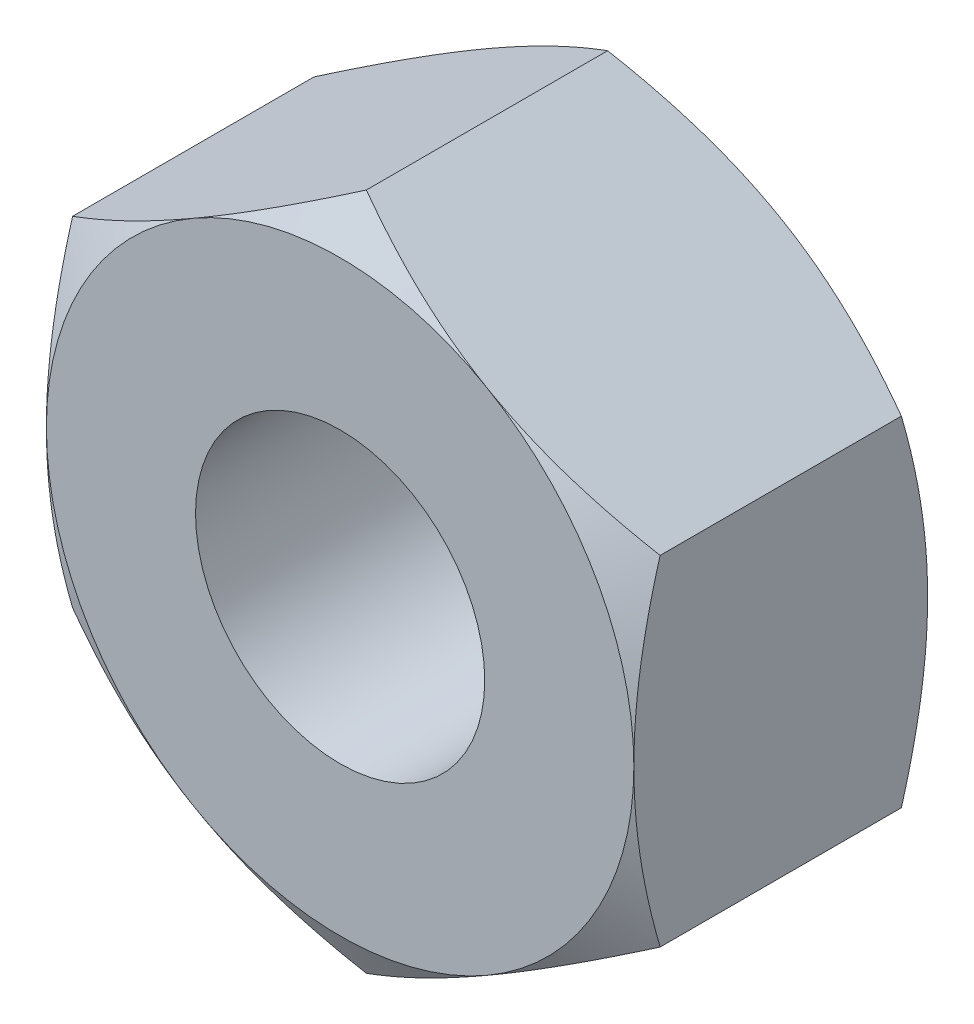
ISO-10303-21;
HEADER;
FILE_DESCRIPTION(('STEP AP214'),'2;1');
FILE_NAME('part.step','',(''),(''),'','','');
FILE_SCHEMA(('AUTOMOTIVE_DESIGN { 1 0 10303 214 1 1 1 1 }'));
ENDSEC;
DATA;
#1=APPLICATION_CONTEXT('core data for automotive mechanical design processes');
#2=APPLICATION_PROTOCOL_DEFINITION('international standard','automotive_design',2000,#1);
#3=PRODUCT_CONTEXT('',#1,'mechanical');
#4=PRODUCT('Part','Part','',(#3));
#5=PRODUCT_RELATED_PRODUCT_CATEGORY('part','',(#4));
#6=PRODUCT_DEFINITION_FORMATION('','',#4);
#7=PRODUCT_DEFINITION_CONTEXT('part definition',#1,'design');
#8=PRODUCT_DEFINITION('design','',#6,#7);
#9=PRODUCT_DEFINITION_SHAPE('','',#8);
#10=(LENGTH_UNIT() NAMED_UNIT(*) SI_UNIT(.MILLI.,.METRE.));
#11=(NAMED_UNIT(*) PLANE_ANGLE_UNIT() SI_UNIT($,.RADIAN.));
#12=(NAMED_UNIT(*) SI_UNIT($,.STERADIAN.) SOLID_ANGLE_UNIT());
#13=UNCERTAINTY_MEASURE_WITH_UNIT(LENGTH_MEASURE(1.E-05),#10,'distance_accuracy_value','');
#14=(GEOMETRIC_REPRESENTATION_CONTEXT(3) GLOBAL_UNCERTAINTY_ASSIGNED_CONTEXT((#13)) GLOBAL_UNIT_ASSIGNED_CONTEXT((#10,
#11,#12)) REPRESENTATION_CONTEXT('',''));
#15=CARTESIAN_POINT('',(0.,0.,0.));
#16=DIRECTION('',(0.,0.,1.));
#17=DIRECTION('',(1.,0.,0.));
#18=AXIS2_PLACEMENT_3D('',#15,#16,#17);
#19=CARTESIAN_POINT('',(-6.5,11.2583302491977,0.));
#20=DIRECTION('',(0.,0.,-1.));
#21=DIRECTION('',(-1.,0.,0.));
#22=AXIS2_PLACEMENT_3D('',#19,#20,#21);
#23=PLANE('',#22);
#24=CARTESIAN_POINT('',(0.,0.,0.));
#25=DIRECTION('',(0.,0.,-1.));
#26=DIRECTION('',(-1.,0.,0.));
#27=AXIS2_PLACEMENT_3D('',#24,#25,#26);
#28=CIRCLE('',#27,6.5);
#29=CARTESIAN_POINT('',(-6.5,0.,0.));
#30=VERTEX_POINT('',#29);
#31=CARTESIAN_POINT('',(-3.25,5.62916512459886,0.));
#32=VERTEX_POINT('',#31);
#33=EDGE_CURVE('E474',#30,#32,#28,.T.);
#34=ORIENTED_EDGE('',*,*,#33,.F.);
#35=CARTESIAN_POINT('',(0.,0.,0.));
#36=DIRECTION('',(0.,0.,-1.));
#37=DIRECTION('',(-1.,0.,0.));
#38=AXIS2_PLACEMENT_3D('',#35,#36,#37);
#39=CIRCLE('',#38,6.5);
#40=CARTESIAN_POINT('',(-3.25,-5.62916512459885,0.));
#41=VERTEX_POINT('',#40);
#42=EDGE_CURVE('E151',#30,#41,#39,.F.);
#43=ORIENTED_EDGE('',*,*,#42,.T.);
#44=CARTESIAN_POINT('',(3.25,-5.62916512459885,0.));
#45=VERTEX_POINT('',#44);
#46=EDGE_CURVE('E253',#41,#45,#39,.F.);
#47=ORIENTED_EDGE('',*,*,#46,.T.);
#48=CARTESIAN_POINT('',(6.5,0.,0.));
#49=VERTEX_POINT('',#48);
#50=EDGE_CURVE('E155',#45,#49,#39,.F.);
#51=ORIENTED_EDGE('',*,*,#50,.T.);
#52=CARTESIAN_POINT('',(3.25,5.62916512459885,0.));
#53=VERTEX_POINT('',#52);
#54=EDGE_CURVE('E129',#49,#53,#39,.F.);
#55=ORIENTED_EDGE('',*,*,#54,.T.);
#56=EDGE_CURVE('E142',#53,#32,#39,.F.);
#57=ORIENTED_EDGE('',*,*,#56,.T.);
#58=EDGE_LOOP('',(#34,#43,#47,#51,#55,#57));
#59=FACE_BOUND('',#58,.T.);
#60=CARTESIAN_POINT('',(0.,0.,0.));
#61=DIRECTION('',(0.,0.,1.));
#62=DIRECTION('',(1.,0.,0.));
#63=AXIS2_PLACEMENT_3D('',#60,#61,#62);
#64=CIRCLE('',#63,3.2);
#65=CARTESIAN_POINT('',(3.2,0.,0.));
#66=VERTEX_POINT('',#65);
#67=EDGE_CURVE('E467',#66,#66,#64,.T.);
#68=ORIENTED_EDGE('',*,*,#67,.F.);
#69=EDGE_LOOP('',(#68));
#70=FACE_BOUND('',#69,.T.);
#71=ADVANCED_FACE('F34',(#59,#70),#23,.F.);
#72=CARTESIAN_POINT('',(0.,0.,0.));
#73=DIRECTION('',(0.,0.,-1.));
#74=DIRECTION('',(-1.,0.,0.));
#75=AXIS2_PLACEMENT_3D('',#72,#73,#74);
#76=CONICAL_SURFACE('',#75,6.5,1.0471975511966);
#77=CARTESIAN_POINT('',(-6.5,-10.0985149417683,-3.18095730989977));
#78=CARTESIAN_POINT('',(-6.5,-9.81442448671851,-3.04307530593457));
#79=CARTESIAN_POINT('',(-6.5,-9.52968373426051,-2.90651030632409));
#80=CARTESIAN_POINT('',(-6.5,-8.95855580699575,-2.63675480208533));
#81=CARTESIAN_POINT('',(-6.5,-8.67216838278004,-2.50356482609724));
#82=CARTESIAN_POINT('',(-6.5,-8.09593488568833,-2.24063387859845));
#83=CARTESIAN_POINT('',(-6.5,-7.80607848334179,-2.11091546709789));
#84=CARTESIAN_POINT('',(-6.5,-7.22406608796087,-1.85676431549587));
#85=CARTESIAN_POINT('',(-6.5,-6.93191020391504,-1.73233132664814));
#86=CARTESIAN_POINT('',(-6.5,-6.33541861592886,-1.48626189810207));
#87=CARTESIAN_POINT('',(-6.5,-6.03099269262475,-1.36484297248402));
#88=CARTESIAN_POINT('',(-6.5,-5.41858592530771,-1.13115091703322));
#89=CARTESIAN_POINT('',(-6.5,-5.11060468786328,-1.01887881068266));
#90=CARTESIAN_POINT('',(-6.5,-4.49116870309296,-0.80641352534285));
#91=CARTESIAN_POINT('',(-6.5,-4.17972236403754,-0.706196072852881));
#92=CARTESIAN_POINT('',(-6.5,-3.55235928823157,-0.521044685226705));
#93=CARTESIAN_POINT('',(-6.5,-3.23644398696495,-0.436105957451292));
#94=CARTESIAN_POINT('',(-6.5,-2.6016924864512,-0.286014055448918));
#95=CARTESIAN_POINT('',(-6.5,-2.28288159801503,-0.220755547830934));
#96=CARTESIAN_POINT('',(-6.5,-1.64123192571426,-0.113730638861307));
#97=CARTESIAN_POINT('',(-6.5,-1.31839354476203,-0.0719619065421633));
#98=CARTESIAN_POINT('',(-6.5,-0.834548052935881,-0.0296987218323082));
#99=CARTESIAN_POINT('',(-6.5,-0.674391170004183,-0.0190142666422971));
#100=CARTESIAN_POINT('',(-6.5,-0.353761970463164,-0.00442284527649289));
#101=CARTESIAN_POINT('',(-6.5,-0.193289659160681,-0.000515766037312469));
#102=CARTESIAN_POINT('',(-6.5,0.127675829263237,0.000420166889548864));
#103=CARTESIAN_POINT('',(-6.5,0.288169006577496,-0.00255104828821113));
#104=CARTESIAN_POINT('',(-6.5,0.60888746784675,-0.0152969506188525));
#105=CARTESIAN_POINT('',(-6.5,0.769112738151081,-0.0250719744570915));
#106=CARTESIAN_POINT('',(-6.5,1.15356140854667,-0.0564825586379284));
#107=CARTESIAN_POINT('',(-6.5,1.37752936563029,-0.0813118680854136));
#108=CARTESIAN_POINT('',(-6.5,1.82380504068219,-0.142915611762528));
#109=CARTESIAN_POINT('',(-6.5,2.04611253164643,-0.179691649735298));
#110=CARTESIAN_POINT('',(-6.5,2.71028289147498,-0.305989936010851));
#111=CARTESIAN_POINT('',(-6.5,3.14915331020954,-0.411460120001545));
#112=CARTESIAN_POINT('',(-6.5,3.80555173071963,-0.594419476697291));
#113=CARTESIAN_POINT('',(-6.5,4.02648029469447,-0.660410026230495));
#114=CARTESIAN_POINT('',(-6.5,4.46619094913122,-0.799255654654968));
#115=CARTESIAN_POINT('',(-6.5,4.68497302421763,-0.872110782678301));
#116=CARTESIAN_POINT('',(-6.5,5.12046127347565,-1.02351546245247));
#117=CARTESIAN_POINT('',(-6.5,5.33716808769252,-1.10206318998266));
#118=CARTESIAN_POINT('',(-6.5,5.76878342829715,-1.26392758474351));
#119=CARTESIAN_POINT('',(-6.5,5.98369198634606,-1.34724416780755));
#120=CARTESIAN_POINT('',(-6.5,6.5321333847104,-1.56574701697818));
#121=CARTESIAN_POINT('',(-6.5,6.86452551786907,-1.70379279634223));
#122=CARTESIAN_POINT('',(-6.5,7.52616114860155,-1.98725828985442));
#123=CARTESIAN_POINT('',(-6.5,7.85540437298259,-2.1326786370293));
#124=CARTESIAN_POINT('',(-6.5,8.51141095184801,-2.42925370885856));
#125=CARTESIAN_POINT('',(-6.5,8.8381735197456,-2.58041016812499));
#126=CARTESIAN_POINT('',(-6.5,9.48958511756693,-2.8871718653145));
#127=CARTESIAN_POINT('',(-6.5,9.81423421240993,-3.0427769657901));
#128=CARTESIAN_POINT('',(-6.5,10.4622514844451,-3.35773382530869));
#129=CARTESIAN_POINT('',(-6.5,10.7856173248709,-3.51709038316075));
#130=CARTESIAN_POINT('',(-6.5,11.4309268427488,-3.83865748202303));
#131=CARTESIAN_POINT('',(-6.5,11.7528705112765,-4.00086804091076));
#132=CARTESIAN_POINT('',(-6.5,12.7168301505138,-4.49089619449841));
#133=CARTESIAN_POINT('',(-6.5,13.357090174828,-4.82216687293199));
#134=CARTESIAN_POINT('',(-6.5,14.5727884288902,-5.45876646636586));
#135=CARTESIAN_POINT('',(-6.5,15.1485293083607,-5.76352010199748));
#136=CARTESIAN_POINT('',(-6.5,16.2980144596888,-6.37683449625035));
#137=CARTESIAN_POINT('',(-6.5,16.8717586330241,-6.685395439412));
#138=CARTESIAN_POINT('',(-6.5,18.0160290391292,-7.30445932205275));
#139=CARTESIAN_POINT('',(-6.5,18.5865597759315,-7.61495394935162));
#140=CARTESIAN_POINT('',(-6.5,19.7263670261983,-8.23814804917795));
#141=CARTESIAN_POINT('',(-6.5,20.2956436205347,-8.55084737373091));
#142=CARTESIAN_POINT('',(-6.5,20.8644710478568,-8.86435647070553));
#143=B_SPLINE_CURVE_WITH_KNOTS('',3,(#77,#78,#79,#80,#81,#82,#83,#84,#85,#86,#87,#88,#89,#90,
#91,#92,#93,#94,#95,#96,#97,#98,#99,#100,#101,#102,#103,#104,#105,#106,#107,#108,#109,#110,#111,
#112,#113,#114,#115,#116,#117,#118,#119,#120,#121,#122,#123,#124,#125,#126,#127,#128,#129,#130,
#131,#132,#133,#134,#135,#136,#137,#138,#139,#140,#141,#142),.UNSPECIFIED.,.F.,.F.,(4,2,2,2,2,2,
2,2,2,2,2,2,2,2,2,2,2,2,2,2,2,2,2,2,2,2,2,2,2,2,2,2,4),(0.,0.947360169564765,1.89486782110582,
2.84750200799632,3.80009131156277,4.78321700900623,5.76645256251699,6.74767387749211,
7.72858686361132,8.70415257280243,9.67962145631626,10.1610384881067,10.6424474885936,
11.1238613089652,11.6052989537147,12.2809380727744,12.9566679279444,14.3088484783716,
15.0005111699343,15.6921788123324,16.3836257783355,17.0750605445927,18.1546874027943,
19.2344070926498,20.3144559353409,21.3944714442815,22.4759529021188,23.5574411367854,
25.7200319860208,27.6742871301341,29.628637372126,31.5772753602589,33.5257837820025),.UNSPECIFIED.);
#144=CARTESIAN_POINT('',(-6.5,3.75277674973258,-0.580556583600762));
#145=VERTEX_POINT('',#144);
#146=EDGE_CURVE('E160',#145,#30,#143,.F.);
#147=ORIENTED_EDGE('',*,*,#146,.T.);
#148=ORIENTED_EDGE('',*,*,#33,.T.);
#149=CARTESIAN_POINT('',(0.000200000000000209,7.50566896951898,-0.580623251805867));
#150=CARTESIAN_POINT('',(-0.14267745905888,7.42317863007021,-0.533004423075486));
#151=CARTESIAN_POINT('',(-0.286087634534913,7.34038072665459,-0.487546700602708));
#152=CARTESIAN_POINT('',(-0.574072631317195,7.17411251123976,-0.401548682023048));
#153=CARTESIAN_POINT('',(-0.718647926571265,7.09064192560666,-0.361010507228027));
#154=CARTESIAN_POINT('',(-1.15468865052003,6.8388936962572,-0.247571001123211));
#155=CARTESIAN_POINT('',(-1.44787528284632,6.66962231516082,-0.183047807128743));
#156=CARTESIAN_POINT('',(-1.88662374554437,6.41631077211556,-0.107386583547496));
#157=CARTESIAN_POINT('',(-2.03087463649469,6.33302748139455,-0.0858328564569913));
#158=CARTESIAN_POINT('',(-2.32002821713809,6.16608458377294,-0.0496903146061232));
#159=CARTESIAN_POINT('',(-2.46493084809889,6.08242501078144,-0.0351008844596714));
#160=CARTESIAN_POINT('',(-2.75498777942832,5.91496056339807,-0.013258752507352));
#161=CARTESIAN_POINT('',(-2.90014160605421,5.83115596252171,-0.00599772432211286));
#162=CARTESIAN_POINT('',(-3.19057533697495,5.66347396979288,0.00103969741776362));
#163=CARTESIAN_POINT('',(-3.33585523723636,5.57959658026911,0.000816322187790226));
#164=CARTESIAN_POINT('',(-3.7338759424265,5.34979921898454,-0.0100834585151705));
#165=CARTESIAN_POINT('',(-3.98648646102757,5.20395446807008,-0.0283818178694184));
#166=CARTESIAN_POINT('',(-4.49002967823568,4.91323365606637,-0.0864063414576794));
#167=CARTESIAN_POINT('',(-4.74096060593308,4.76835861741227,-0.126152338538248));
#168=CARTESIAN_POINT('',(-5.24551722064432,4.47705272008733,-0.225505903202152));
#169=CARTESIAN_POINT('',(-5.49907924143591,4.33065861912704,-0.285534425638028));
#170=CARTESIAN_POINT('',(-6.00242193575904,4.04005357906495,-0.421774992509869));
#171=CARTESIAN_POINT('',(-6.25220905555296,3.89583891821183,-0.497955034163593));
#172=CARTESIAN_POINT('',(-6.5002,3.75266127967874,-0.580623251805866));
#173=B_SPLINE_CURVE_WITH_KNOTS('',3,(#149,#150,#151,#152,#153,#154,#155,#156,#157,#158,#159,
#160,#161,#162,#163,#164,#165,#166,#167,#168,#169,#170,#171,#172),.UNSPECIFIED.,.F.,.F.,(4,2,2,
2,2,2,2,2,2,2,2,4),(0.,0.515105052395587,1.03043143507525,2.06322554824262,2.56697389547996,
3.07067772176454,3.57380860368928,4.0769239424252,4.9527935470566,5.82947446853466,
6.72559912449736,7.61996451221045),.UNSPECIFIED.);
#174=EDGE_CURVE('E192',#32,#145,#173,.T.);
#175=ORIENTED_EDGE('',*,*,#174,.T.);
#176=EDGE_LOOP('',(#147,#148,#175));
#177=FACE_BOUND('',#176,.T.);
#178=ADVANCED_FACE('F179',(#177),#76,.T.);
#179=CARTESIAN_POINT('',(6.5002,3.75266127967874,-0.580623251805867));
#180=CARTESIAN_POINT('',(6.35732254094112,3.83515161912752,-0.533004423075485));
#181=CARTESIAN_POINT('',(6.21391236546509,3.91794952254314,-0.487546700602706));
#182=CARTESIAN_POINT('',(5.9259273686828,4.08421773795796,-0.401548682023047));
#183=CARTESIAN_POINT('',(5.78135207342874,4.16768832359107,-0.361010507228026));
#184=CARTESIAN_POINT('',(5.34531134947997,4.41943655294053,-0.247571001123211));
#185=CARTESIAN_POINT('',(5.05212471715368,4.58870793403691,-0.183047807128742));
#186=CARTESIAN_POINT('',(4.61337625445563,4.84201947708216,-0.107386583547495));
#187=CARTESIAN_POINT('',(4.46912536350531,4.92530276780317,-0.0858328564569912));
#188=CARTESIAN_POINT('',(4.17997178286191,5.09224566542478,-0.0496903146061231));
#189=CARTESIAN_POINT('',(4.03506915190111,5.17590523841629,-0.035100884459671));
#190=CARTESIAN_POINT('',(3.74501222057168,5.34336968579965,-0.0132587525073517));
#191=CARTESIAN_POINT('',(3.59985839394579,5.42717428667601,-0.005997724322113));
#192=CARTESIAN_POINT('',(3.30942466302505,5.59485627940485,0.00103969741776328));
#193=CARTESIAN_POINT('',(3.16414476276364,5.67873366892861,0.000816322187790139));
#194=CARTESIAN_POINT('',(2.7661240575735,5.90853103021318,-0.0100834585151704));
#195=CARTESIAN_POINT('',(2.51351353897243,6.05437578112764,-0.0283818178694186));
#196=CARTESIAN_POINT('',(2.00997032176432,6.34509659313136,-0.0864063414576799));
#197=CARTESIAN_POINT('',(1.75903939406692,6.48997163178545,-0.126152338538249));
#198=CARTESIAN_POINT('',(1.25448277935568,6.78127752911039,-0.225505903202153));
#199=CARTESIAN_POINT('',(1.00092075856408,6.92767163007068,-0.28553442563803));
#200=CARTESIAN_POINT('',(0.497578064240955,7.21827667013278,-0.42177499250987));
#201=CARTESIAN_POINT('',(0.247790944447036,7.3624913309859,-0.497955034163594));
#202=CARTESIAN_POINT('',(-0.000199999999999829,7.50566896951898,-0.580623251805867));
#203=B_SPLINE_CURVE_WITH_KNOTS('',3,(#179,#180,#181,#182,#183,#184,#185,#186,#187,#188,#189,
#190,#191,#192,#193,#194,#195,#196,#197,#198,#199,#200,#201,#202),.UNSPECIFIED.,.F.,.F.,(4,2,2,
2,2,2,2,2,2,2,2,4),(0.,0.515105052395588,1.03043143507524,2.06322554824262,2.56697389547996,
3.07067772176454,3.57380860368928,4.0769239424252,4.9527935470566,5.82947446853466,
6.72559912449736,7.61996451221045),.UNSPECIFIED.);
#204=CARTESIAN_POINT('',(0.,7.50555349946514,-0.580556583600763));
#205=VERTEX_POINT('',#204);
#206=EDGE_CURVE('E138',#53,#205,#203,.T.);
#207=ORIENTED_EDGE('',*,*,#206,.T.);
#208=EDGE_CURVE('E145',#205,#32,#173,.T.);
#209=ORIENTED_EDGE('',*,*,#208,.T.);
#210=ORIENTED_EDGE('',*,*,#56,.F.);
#211=EDGE_LOOP('',(#207,#209,#210));
#212=FACE_BOUND('',#211,.T.);
#213=ADVANCED_FACE('F143',(#212),#76,.T.);
#214=CARTESIAN_POINT('',(6.5,-10.0985149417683,-3.18095730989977));
#215=CARTESIAN_POINT('',(6.5,-9.81442448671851,-3.04307530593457));
#216=CARTESIAN_POINT('',(6.5,-9.52968373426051,-2.90651030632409));
#217=CARTESIAN_POINT('',(6.5,-8.95855580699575,-2.63675480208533));
#218=CARTESIAN_POINT('',(6.5,-8.67216838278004,-2.50356482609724));
#219=CARTESIAN_POINT('',(6.5,-8.09593488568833,-2.24063387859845));
#220=CARTESIAN_POINT('',(6.5,-7.80607848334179,-2.11091546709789));
#221=CARTESIAN_POINT('',(6.5,-7.22406608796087,-1.85676431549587));
#222=CARTESIAN_POINT('',(6.5,-6.93191020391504,-1.73233132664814));
#223=CARTESIAN_POINT('',(6.5,-6.33541861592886,-1.48626189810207));
#224=CARTESIAN_POINT('',(6.5,-6.03099269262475,-1.36484297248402));
#225=CARTESIAN_POINT('',(6.5,-5.41858592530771,-1.13115091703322));
#226=CARTESIAN_POINT('',(6.5,-5.11060468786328,-1.01887881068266));
#227=CARTESIAN_POINT('',(6.5,-4.49116870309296,-0.80641352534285));
#228=CARTESIAN_POINT('',(6.5,-4.17972236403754,-0.706196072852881));
#229=CARTESIAN_POINT('',(6.5,-3.55235928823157,-0.521044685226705));
#230=CARTESIAN_POINT('',(6.5,-3.23644398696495,-0.436105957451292));
#231=CARTESIAN_POINT('',(6.5,-2.6016924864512,-0.286014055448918));
#232=CARTESIAN_POINT('',(6.5,-2.28288159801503,-0.220755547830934));
#233=CARTESIAN_POINT('',(6.5,-1.64123192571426,-0.113730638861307));
#234=CARTESIAN_POINT('',(6.5,-1.31839354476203,-0.0719619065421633));
#235=CARTESIAN_POINT('',(6.5,-0.834548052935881,-0.0296987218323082));
#236=CARTESIAN_POINT('',(6.5,-0.674391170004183,-0.0190142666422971));
#237=CARTESIAN_POINT('',(6.5,-0.353761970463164,-0.00442284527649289));
#238=CARTESIAN_POINT('',(6.5,-0.193289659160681,-0.000515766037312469));
#239=CARTESIAN_POINT('',(6.5,0.127675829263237,0.000420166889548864));
#240=CARTESIAN_POINT('',(6.5,0.288169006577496,-0.00255104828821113));
#241=CARTESIAN_POINT('',(6.5,0.60888746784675,-0.0152969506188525));
#242=CARTESIAN_POINT('',(6.5,0.769112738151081,-0.0250719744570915));
#243=CARTESIAN_POINT('',(6.5,1.15356140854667,-0.0564825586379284));
#244=CARTESIAN_POINT('',(6.5,1.37752936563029,-0.0813118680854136));
#245=CARTESIAN_POINT('',(6.5,1.82380504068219,-0.142915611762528));
#246=CARTESIAN_POINT('',(6.5,2.04611253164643,-0.179691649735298));
#247=CARTESIAN_POINT('',(6.5,2.71028289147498,-0.305989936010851));
#248=CARTESIAN_POINT('',(6.5,3.14915331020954,-0.411460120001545));
#249=CARTESIAN_POINT('',(6.5,3.80555173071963,-0.594419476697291));
#250=CARTESIAN_POINT('',(6.5,4.02648029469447,-0.660410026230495));
#251=CARTESIAN_POINT('',(6.5,4.46619094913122,-0.799255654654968));
#252=CARTESIAN_POINT('',(6.5,4.68497302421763,-0.872110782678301));
#253=CARTESIAN_POINT('',(6.5,5.12046127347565,-1.02351546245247));
#254=CARTESIAN_POINT('',(6.5,5.33716808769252,-1.10206318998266));
#255=CARTESIAN_POINT('',(6.5,5.76878342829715,-1.26392758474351));
#256=CARTESIAN_POINT('',(6.5,5.98369198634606,-1.34724416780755));
#257=CARTESIAN_POINT('',(6.5,6.5321333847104,-1.56574701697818));
#258=CARTESIAN_POINT('',(6.5,6.86452551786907,-1.70379279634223));
#259=CARTESIAN_POINT('',(6.5,7.52616114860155,-1.98725828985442));
#260=CARTESIAN_POINT('',(6.5,7.85540437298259,-2.1326786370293));
#261=CARTESIAN_POINT('',(6.5,8.51141095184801,-2.42925370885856));
#262=CARTESIAN_POINT('',(6.5,8.8381735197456,-2.58041016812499));
#263=CARTESIAN_POINT('',(6.5,9.48958511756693,-2.8871718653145));
#264=CARTESIAN_POINT('',(6.5,9.81423421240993,-3.0427769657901));
#265=CARTESIAN_POINT('',(6.5,10.4622514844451,-3.35773382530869));
#266=CARTESIAN_POINT('',(6.5,10.7856173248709,-3.51709038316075));
#267=CARTESIAN_POINT('',(6.5,11.4309268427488,-3.83865748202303));
#268=CARTESIAN_POINT('',(6.5,11.7528705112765,-4.00086804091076));
#269=CARTESIAN_POINT('',(6.5,12.7168301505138,-4.49089619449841));
#270=CARTESIAN_POINT('',(6.5,13.357090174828,-4.82216687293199));
#271=CARTESIAN_POINT('',(6.5,14.5727884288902,-5.45876646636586));
#272=CARTESIAN_POINT('',(6.5,15.1485293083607,-5.76352010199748));
#273=CARTESIAN_POINT('',(6.5,16.2980144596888,-6.37683449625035));
#274=CARTESIAN_POINT('',(6.5,16.8717586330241,-6.685395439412));
#275=CARTESIAN_POINT('',(6.5,18.0160290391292,-7.30445932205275));
#276=CARTESIAN_POINT('',(6.5,18.5865597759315,-7.61495394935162));
#277=CARTESIAN_POINT('',(6.5,19.7263670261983,-8.23814804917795));
#278=CARTESIAN_POINT('',(6.5,20.2956436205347,-8.55084737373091));
#279=CARTESIAN_POINT('',(6.5,20.8644710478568,-8.86435647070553));
#280=B_SPLINE_CURVE_WITH_KNOTS('',3,(#214,#215,#216,#217,#218,#219,#220,#221,#222,#223,#224,
#225,#226,#227,#228,#229,#230,#231,#232,#233,#234,#235,#236,#237,#238,#239,#240,#241,#242,#243,
#244,#245,#246,#247,#248,#249,#250,#251,#252,#253,#254,#255,#256,#257,#258,#259,#260,#261,#262,
#263,#264,#265,#266,#267,#268,#269,#270,#271,#272,#273,#274,#275,#276,#277,#278,#279),
.UNSPECIFIED.,.F.,.F.,(4,2,2,2,2,2,2,2,2,2,2,2,2,2,2,2,2,2,2,2,2,2,2,2,2,2,2,2,2,2,2,2,4),(0.,
0.947360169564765,1.89486782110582,2.84750200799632,3.80009131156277,4.78321700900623,
5.76645256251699,6.74767387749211,7.72858686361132,8.70415257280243,9.67962145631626,
10.1610384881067,10.6424474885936,11.1238613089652,11.6052989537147,12.2809380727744,
12.9566679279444,14.3088484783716,15.0005111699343,15.6921788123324,16.3836257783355,
17.0750605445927,18.1546874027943,19.2344070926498,20.3144559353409,21.3944714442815,
22.4759529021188,23.5574411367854,25.7200319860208,27.6742871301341,29.628637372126,
31.5772753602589,33.5257837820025),.UNSPECIFIED.);
#281=CARTESIAN_POINT('',(6.5,3.75277674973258,-0.580556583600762));
#282=VERTEX_POINT('',#281);
#283=EDGE_CURVE('E132',#49,#282,#280,.T.);
#284=ORIENTED_EDGE('',*,*,#283,.T.);
#285=EDGE_CURVE('E125',#282,#53,#203,.T.);
#286=ORIENTED_EDGE('',*,*,#285,.T.);
#287=ORIENTED_EDGE('',*,*,#54,.F.);
#288=EDGE_LOOP('',(#284,#286,#287));
#289=FACE_BOUND('',#288,.T.);
#290=ADVANCED_FACE('F127',(#289),#76,.T.);
#291=CARTESIAN_POINT('',(-0.000200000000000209,-7.50566896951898,-0.580623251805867));
#292=CARTESIAN_POINT('',(0.14267745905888,-7.42317863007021,-0.533004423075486));
#293=CARTESIAN_POINT('',(0.286087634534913,-7.34038072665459,-0.487546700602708));
#294=CARTESIAN_POINT('',(0.574072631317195,-7.17411251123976,-0.401548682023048));
#295=CARTESIAN_POINT('',(0.718647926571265,-7.09064192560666,-0.361010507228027));
#296=CARTESIAN_POINT('',(1.15468865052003,-6.8388936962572,-0.247571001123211));
#297=CARTESIAN_POINT('',(1.44787528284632,-6.66962231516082,-0.183047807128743));
#298=CARTESIAN_POINT('',(1.88662374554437,-6.41631077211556,-0.107386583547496));
#299=CARTESIAN_POINT('',(2.03087463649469,-6.33302748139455,-0.0858328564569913));
#300=CARTESIAN_POINT('',(2.32002821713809,-6.16608458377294,-0.0496903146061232));
#301=CARTESIAN_POINT('',(2.46493084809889,-6.08242501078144,-0.0351008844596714));
#302=CARTESIAN_POINT('',(2.75498777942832,-5.91496056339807,-0.013258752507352));
#303=CARTESIAN_POINT('',(2.90014160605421,-5.83115596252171,-0.00599772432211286));
#304=CARTESIAN_POINT('',(3.19057533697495,-5.66347396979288,0.00103969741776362));
#305=CARTESIAN_POINT('',(3.33585523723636,-5.57959658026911,0.000816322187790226));
#306=CARTESIAN_POINT('',(3.7338759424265,-5.34979921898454,-0.0100834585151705));
#307=CARTESIAN_POINT('',(3.98648646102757,-5.20395446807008,-0.0283818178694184));
#308=CARTESIAN_POINT('',(4.49002967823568,-4.91323365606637,-0.0864063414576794));
#309=CARTESIAN_POINT('',(4.74096060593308,-4.76835861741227,-0.126152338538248));
#310=CARTESIAN_POINT('',(5.24551722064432,-4.47705272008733,-0.225505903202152));
#311=CARTESIAN_POINT('',(5.49907924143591,-4.33065861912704,-0.285534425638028));
#312=CARTESIAN_POINT('',(6.00242193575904,-4.04005357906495,-0.421774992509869));
#313=CARTESIAN_POINT('',(6.25220905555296,-3.89583891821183,-0.497955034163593));
#314=CARTESIAN_POINT('',(6.5002,-3.75266127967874,-0.580623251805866));
#315=B_SPLINE_CURVE_WITH_KNOTS('',3,(#291,#292,#293,#294,#295,#296,#297,#298,#299,#300,#301,
#302,#303,#304,#305,#306,#307,#308,#309,#310,#311,#312,#313,#314),.UNSPECIFIED.,.F.,.F.,(4,2,2,
2,2,2,2,2,2,2,2,4),(0.,0.515105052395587,1.03043143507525,2.06322554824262,2.56697389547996,
3.07067772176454,3.57380860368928,4.0769239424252,4.9527935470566,5.82947446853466,
6.72559912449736,7.61996451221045),.UNSPECIFIED.);
#316=CARTESIAN_POINT('',(6.5,-3.75277674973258,-0.580556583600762));
#317=VERTEX_POINT('',#316);
#318=EDGE_CURVE('E206',#45,#317,#315,.T.);
#319=ORIENTED_EDGE('',*,*,#318,.T.);
#320=EDGE_CURVE('E205',#317,#49,#280,.T.);
#321=ORIENTED_EDGE('',*,*,#320,.T.);
#322=ORIENTED_EDGE('',*,*,#50,.F.);
#323=EDGE_LOOP('',(#319,#321,#322));
#324=FACE_BOUND('',#323,.T.);
#325=ADVANCED_FACE('F335',(#324),#76,.T.);
#326=CARTESIAN_POINT('',(0.,-7.50555349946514,-0.580556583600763));
#327=VERTEX_POINT('',#326);
#328=EDGE_CURVE('E263',#327,#45,#315,.T.);
#329=ORIENTED_EDGE('',*,*,#328,.T.);
#330=ORIENTED_EDGE('',*,*,#46,.F.);
#331=CARTESIAN_POINT('',(-6.5002,-3.75266127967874,-0.580623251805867));
#332=CARTESIAN_POINT('',(-6.35732254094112,-3.83515161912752,-0.533004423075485));
#333=CARTESIAN_POINT('',(-6.21391236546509,-3.91794952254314,-0.487546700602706));
#334=CARTESIAN_POINT('',(-5.9259273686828,-4.08421773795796,-0.401548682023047));
#335=CARTESIAN_POINT('',(-5.78135207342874,-4.16768832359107,-0.361010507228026));
#336=CARTESIAN_POINT('',(-5.34531134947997,-4.41943655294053,-0.247571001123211));
#337=CARTESIAN_POINT('',(-5.05212471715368,-4.58870793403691,-0.183047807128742));
#338=CARTESIAN_POINT('',(-4.61337625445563,-4.84201947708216,-0.107386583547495));
#339=CARTESIAN_POINT('',(-4.46912536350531,-4.92530276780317,-0.0858328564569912));
#340=CARTESIAN_POINT('',(-4.17997178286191,-5.09224566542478,-0.0496903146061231));
#341=CARTESIAN_POINT('',(-4.03506915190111,-5.17590523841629,-0.035100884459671));
#342=CARTESIAN_POINT('',(-3.74501222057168,-5.34336968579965,-0.0132587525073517));
#343=CARTESIAN_POINT('',(-3.59985839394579,-5.42717428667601,-0.005997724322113));
#344=CARTESIAN_POINT('',(-3.30942466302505,-5.59485627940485,0.00103969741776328));
#345=CARTESIAN_POINT('',(-3.16414476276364,-5.67873366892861,0.000816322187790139));
#346=CARTESIAN_POINT('',(-2.7661240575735,-5.90853103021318,-0.0100834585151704));
#347=CARTESIAN_POINT('',(-2.51351353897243,-6.05437578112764,-0.0283818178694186));
#348=CARTESIAN_POINT('',(-2.00997032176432,-6.34509659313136,-0.0864063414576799));
#349=CARTESIAN_POINT('',(-1.75903939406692,-6.48997163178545,-0.126152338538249));
#350=CARTESIAN_POINT('',(-1.25448277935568,-6.78127752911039,-0.225505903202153));
#351=CARTESIAN_POINT('',(-1.00092075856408,-6.92767163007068,-0.28553442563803));
#352=CARTESIAN_POINT('',(-0.497578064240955,-7.21827667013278,-0.42177499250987));
#353=CARTESIAN_POINT('',(-0.247790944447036,-7.3624913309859,-0.497955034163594));
#354=CARTESIAN_POINT('',(0.000199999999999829,-7.50566896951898,-0.580623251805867));
#355=B_SPLINE_CURVE_WITH_KNOTS('',3,(#331,#332,#333,#334,#335,#336,#337,#338,#339,#340,#341,
#342,#343,#344,#345,#346,#347,#348,#349,#350,#351,#352,#353,#354),.UNSPECIFIED.,.F.,.F.,(4,2,2,
2,2,2,2,2,2,2,2,4),(0.,0.515105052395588,1.03043143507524,2.06322554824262,2.56697389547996,
3.07067772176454,3.57380860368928,4.0769239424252,4.9527935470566,5.82947446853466,
6.72559912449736,7.61996451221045),.UNSPECIFIED.);
#356=EDGE_CURVE('E267',#41,#327,#355,.T.);
#357=ORIENTED_EDGE('',*,*,#356,.T.);
#358=EDGE_LOOP('',(#329,#330,#357));
#359=FACE_BOUND('',#358,.T.);
#360=ADVANCED_FACE('F185',(#359),#76,.T.);
#361=CARTESIAN_POINT('',(-6.5,-3.75277674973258,-0.580556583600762));
#362=VERTEX_POINT('',#361);
#363=EDGE_CURVE('E173',#362,#41,#355,.T.);
#364=ORIENTED_EDGE('',*,*,#363,.T.);
#365=ORIENTED_EDGE('',*,*,#42,.F.);
#366=EDGE_CURVE('E137',#30,#362,#143,.F.);
#367=ORIENTED_EDGE('',*,*,#366,.T.);
#368=EDGE_LOOP('',(#364,#365,#367));
#369=FACE_BOUND('',#368,.T.);
#370=ADVANCED_FACE('F272',(#369),#76,.T.);
#371=CARTESIAN_POINT('',(6.5,3.75277674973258,-6.5));
#372=DIRECTION('',(0.5,0.866025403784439,0.));
#373=DIRECTION('',(-0.866025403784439,0.5,0.));
#374=AXIS2_PLACEMENT_3D('',#371,#372,#373);
#375=PLANE('',#374);
#376=CARTESIAN_POINT('',(-0.000200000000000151,7.50566896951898,-5.91937674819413));
#377=CARTESIAN_POINT('',(0.14267745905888,7.42317863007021,-5.96699557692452));
#378=CARTESIAN_POINT('',(0.286087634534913,7.34038072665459,-6.01245329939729));
#379=CARTESIAN_POINT('',(0.574072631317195,7.17411251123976,-6.09845131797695));
#380=CARTESIAN_POINT('',(0.718647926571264,7.09064192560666,-6.13898949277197));
#381=CARTESIAN_POINT('',(1.15468865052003,6.8388936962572,-6.25242899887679));
#382=CARTESIAN_POINT('',(1.44787528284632,6.66962231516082,-6.31695219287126));
#383=CARTESIAN_POINT('',(1.88662374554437,6.41631077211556,-6.39261341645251));
#384=CARTESIAN_POINT('',(2.03087463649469,6.33302748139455,-6.41416714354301));
#385=CARTESIAN_POINT('',(2.32002821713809,6.16608458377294,-6.45030968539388));
#386=CARTESIAN_POINT('',(2.46493084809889,6.08242501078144,-6.46489911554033));
#387=CARTESIAN_POINT('',(2.75498777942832,5.91496056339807,-6.48674124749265));
#388=CARTESIAN_POINT('',(2.90014160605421,5.83115596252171,-6.49400227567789));
#389=CARTESIAN_POINT('',(3.19057533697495,5.66347396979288,-6.50103969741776));
#390=CARTESIAN_POINT('',(3.33585523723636,5.57959658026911,-6.50081632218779));
#391=CARTESIAN_POINT('',(3.7338759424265,5.34979921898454,-6.48991654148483));
#392=CARTESIAN_POINT('',(3.98648646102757,5.20395446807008,-6.47161818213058));
#393=CARTESIAN_POINT('',(4.49002967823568,4.91323365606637,-6.41359365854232));
#394=CARTESIAN_POINT('',(4.74096060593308,4.76835861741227,-6.37384766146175));
#395=CARTESIAN_POINT('',(5.24551722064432,4.47705272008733,-6.27449409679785));
#396=CARTESIAN_POINT('',(5.49907924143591,4.33065861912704,-6.21446557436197));
#397=CARTESIAN_POINT('',(6.00242193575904,4.04005357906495,-6.07822500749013));
#398=CARTESIAN_POINT('',(6.25220905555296,3.89583891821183,-6.00204496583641));
#399=CARTESIAN_POINT('',(6.5002,3.75266127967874,-5.91937674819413));
#400=B_SPLINE_CURVE_WITH_KNOTS('',3,(#376,#377,#378,#379,#380,#381,#382,#383,#384,#385,#386,
#387,#388,#389,#390,#391,#392,#393,#394,#395,#396,#397,#398,#399),.UNSPECIFIED.,.F.,.F.,(4,2,2,
2,2,2,2,2,2,2,2,4),(0.,0.515105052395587,1.03043143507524,2.06322554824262,2.56697389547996,
3.07067772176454,3.57380860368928,4.0769239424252,4.9527935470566,5.82947446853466,
6.72559912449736,7.61996451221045),.UNSPECIFIED.);
#401=CARTESIAN_POINT('',(0.,7.50555349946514,-5.91944341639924));
#402=VERTEX_POINT('',#401);
#403=CARTESIAN_POINT('',(3.25,5.62916512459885,-6.5));
#404=VERTEX_POINT('',#403);
#405=EDGE_CURVE('E238',#402,#404,#400,.T.);
#406=ORIENTED_EDGE('',*,*,#405,.F.);
#407=DIRECTION('',(0.,0.,1.));
#408=VECTOR('',#407,1.);
#409=CARTESIAN_POINT('',(0.,7.50555349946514,-6.5));
#410=LINE('',#409,#408);
#411=EDGE_CURVE('E159',#402,#205,#410,.T.);
#412=ORIENTED_EDGE('',*,*,#411,.T.);
#413=ORIENTED_EDGE('',*,*,#206,.F.);
#414=ORIENTED_EDGE('',*,*,#285,.F.);
#415=DIRECTION('',(0.,0.,1.));
#416=VECTOR('',#415,1.);
#417=CARTESIAN_POINT('',(6.5,3.75277674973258,-6.5));
#418=LINE('',#417,#416);
#419=CARTESIAN_POINT('',(6.5,3.75277674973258,-5.91944341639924));
#420=VERTEX_POINT('',#419);
#421=EDGE_CURVE('E150',#420,#282,#418,.T.);
#422=ORIENTED_EDGE('',*,*,#421,.F.);
#423=EDGE_CURVE('E233',#404,#420,#400,.T.);
#424=ORIENTED_EDGE('',*,*,#423,.F.);
#425=EDGE_LOOP('',(#406,#412,#413,#414,#422,#424));
#426=FACE_BOUND('',#425,.T.);
#427=ADVANCED_FACE('F36',(#426),#375,.T.);
#428=CARTESIAN_POINT('',(6.5,-3.75277674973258,-6.5));
#429=DIRECTION('',(1.,0.,0.));
#430=DIRECTION('',(0.,0.,-1.));
#431=AXIS2_PLACEMENT_3D('',#428,#429,#430);
#432=PLANE('',#431);
#433=CARTESIAN_POINT('',(6.5,-10.0985149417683,-3.31904269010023));
#434=CARTESIAN_POINT('',(6.5,-9.81442448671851,-3.45692469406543));
#435=CARTESIAN_POINT('',(6.5,-9.52968373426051,-3.59348969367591));
#436=CARTESIAN_POINT('',(6.5,-8.95855580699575,-3.86324519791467));
#437=CARTESIAN_POINT('',(6.5,-8.67216838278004,-3.99643517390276));
#438=CARTESIAN_POINT('',(6.5,-8.09593488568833,-4.25936612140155));
#439=CARTESIAN_POINT('',(6.5,-7.80607848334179,-4.3890845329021));
#440=CARTESIAN_POINT('',(6.5,-7.22406608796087,-4.64323568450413));
#441=CARTESIAN_POINT('',(6.5,-6.93191020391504,-4.76766867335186));
#442=CARTESIAN_POINT('',(6.5,-6.33541861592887,-5.01373810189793));
#443=CARTESIAN_POINT('',(6.5,-6.03099269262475,-5.13515702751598));
#444=CARTESIAN_POINT('',(6.5,-5.41858592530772,-5.36884908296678));
#445=CARTESIAN_POINT('',(6.5,-5.11060468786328,-5.48112118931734));
#446=CARTESIAN_POINT('',(6.5,-4.49116870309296,-5.69358647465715));
#447=CARTESIAN_POINT('',(6.5,-4.17972236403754,-5.79380392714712));
#448=CARTESIAN_POINT('',(6.5,-3.55235928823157,-5.9789553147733));
#449=CARTESIAN_POINT('',(6.5,-3.23644398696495,-6.06389404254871));
#450=CARTESIAN_POINT('',(6.5,-2.6016924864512,-6.21398594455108));
#451=CARTESIAN_POINT('',(6.5,-2.28288159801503,-6.27924445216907));
#452=CARTESIAN_POINT('',(6.5,-1.64123192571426,-6.38626936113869));
#453=CARTESIAN_POINT('',(6.5,-1.31839354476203,-6.42803809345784));
#454=CARTESIAN_POINT('',(6.5,-0.83454805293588,-6.47030127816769));
#455=CARTESIAN_POINT('',(6.5,-0.674391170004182,-6.4809857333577));
#456=CARTESIAN_POINT('',(6.5,-0.353761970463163,-6.49557715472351));
#457=CARTESIAN_POINT('',(6.5,-0.19328965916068,-6.49948423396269));
#458=CARTESIAN_POINT('',(6.5,0.127675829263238,-6.50042016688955));
#459=CARTESIAN_POINT('',(6.5,0.288169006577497,-6.49744895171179));
#460=CARTESIAN_POINT('',(6.5,0.608887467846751,-6.48470304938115));
#461=CARTESIAN_POINT('',(6.5,0.769112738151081,-6.47492802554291));
#462=CARTESIAN_POINT('',(6.5,1.15356140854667,-6.44351744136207));
#463=CARTESIAN_POINT('',(6.5,1.37752936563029,-6.41868813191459));
#464=CARTESIAN_POINT('',(6.5,1.82380504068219,-6.35708438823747));
#465=CARTESIAN_POINT('',(6.5,2.04611253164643,-6.3203083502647));
#466=CARTESIAN_POINT('',(6.5,2.71028289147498,-6.19401006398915));
#467=CARTESIAN_POINT('',(6.5,3.14915331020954,-6.08853987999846));
#468=CARTESIAN_POINT('',(6.5,3.80555173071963,-5.90558052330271));
#469=CARTESIAN_POINT('',(6.5,4.02648029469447,-5.83958997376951));
#470=CARTESIAN_POINT('',(6.5,4.46619094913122,-5.70074434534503));
#471=CARTESIAN_POINT('',(6.5,4.68497302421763,-5.6278892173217));
#472=CARTESIAN_POINT('',(6.5,5.12046127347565,-5.47648453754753));
#473=CARTESIAN_POINT('',(6.5,5.33716808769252,-5.39793681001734));
#474=CARTESIAN_POINT('',(6.5,5.76878342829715,-5.23607241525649));
#475=CARTESIAN_POINT('',(6.5,5.98369198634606,-5.15275583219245));
#476=CARTESIAN_POINT('',(6.5,6.5321333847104,-4.93425298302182));
#477=CARTESIAN_POINT('',(6.5,6.86452551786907,-4.79620720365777));
#478=CARTESIAN_POINT('',(6.5,7.52616114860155,-4.51274171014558));
#479=CARTESIAN_POINT('',(6.5,7.85540437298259,-4.3673213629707));
#480=CARTESIAN_POINT('',(6.5,8.51141095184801,-4.07074629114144));
#481=CARTESIAN_POINT('',(6.5,8.83817351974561,-3.91958983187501));
#482=CARTESIAN_POINT('',(6.5,9.48958511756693,-3.6128281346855));
#483=CARTESIAN_POINT('',(6.5,9.81423421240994,-3.4572230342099));
#484=CARTESIAN_POINT('',(6.5,10.4622514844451,-3.14226617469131));
#485=CARTESIAN_POINT('',(6.5,10.7856173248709,-2.98290961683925));
#486=CARTESIAN_POINT('',(6.5,11.4309268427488,-2.66134251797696));
#487=CARTESIAN_POINT('',(6.5,11.7528705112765,-2.49913195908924));
#488=CARTESIAN_POINT('',(6.5,12.7168301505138,-2.00910380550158));
#489=CARTESIAN_POINT('',(6.5,13.357090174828,-1.677833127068));
#490=CARTESIAN_POINT('',(6.5,14.5727884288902,-1.04123353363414));
#491=CARTESIAN_POINT('',(6.5,15.1485293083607,-0.736479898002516));
#492=CARTESIAN_POINT('',(6.5,16.2980144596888,-0.123165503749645));
#493=CARTESIAN_POINT('',(6.5,16.8717586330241,0.185395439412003));
#494=CARTESIAN_POINT('',(6.5,18.0160290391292,0.80445932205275));
#495=CARTESIAN_POINT('',(6.5,18.5865597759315,1.11495394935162));
#496=CARTESIAN_POINT('',(6.5,19.7263670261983,1.73814804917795));
#497=CARTESIAN_POINT('',(6.5,20.2956436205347,2.0508473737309));
#498=CARTESIAN_POINT('',(6.5,20.8644710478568,2.36435647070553));
#499=B_SPLINE_CURVE_WITH_KNOTS('',3,(#433,#434,#435,#436,#437,#438,#439,#440,#441,#442,#443,
#444,#445,#446,#447,#448,#449,#450,#451,#452,#453,#454,#455,#456,#457,#458,#459,#460,#461,#462,
#463,#464,#465,#466,#467,#468,#469,#470,#471,#472,#473,#474,#475,#476,#477,#478,#479,#480,#481,
#482,#483,#484,#485,#486,#487,#488,#489,#490,#491,#492,#493,#494,#495,#496,#497,#498),
.UNSPECIFIED.,.F.,.F.,(4,2,2,2,2,2,2,2,2,2,2,2,2,2,2,2,2,2,2,2,2,2,2,2,2,2,2,2,2,2,2,2,4),(0.,
0.947360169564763,1.89486782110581,2.84750200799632,3.80009131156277,4.78321700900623,
5.76645256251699,6.74767387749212,7.72858686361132,8.70415257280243,9.67962145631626,
10.1610384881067,10.6424474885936,11.1238613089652,11.6052989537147,12.2809380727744,
12.9566679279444,14.3088484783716,15.0005111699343,15.6921788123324,16.3836257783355,
17.0750605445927,18.1546874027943,19.2344070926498,20.3144559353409,21.3944714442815,
22.4759529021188,23.5574411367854,25.7200319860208,27.6742871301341,29.628637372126,
31.5772753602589,33.5257837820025),.UNSPECIFIED.);
#500=CARTESIAN_POINT('',(6.5,0.,-6.5));
#501=VERTEX_POINT('',#500);
#502=EDGE_CURVE('E227',#420,#501,#499,.F.);
#503=ORIENTED_EDGE('',*,*,#502,.F.);
#504=ORIENTED_EDGE('',*,*,#421,.T.);
#505=ORIENTED_EDGE('',*,*,#283,.F.);
#506=ORIENTED_EDGE('',*,*,#320,.F.);
#507=DIRECTION('',(0.,0.,1.));
#508=VECTOR('',#507,1.);
#509=CARTESIAN_POINT('',(6.5,-3.75277674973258,-6.5));
#510=LINE('',#509,#508);
#511=CARTESIAN_POINT('',(6.5,-3.75277674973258,-5.91944341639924));
#512=VERTEX_POINT('',#511);
#513=EDGE_CURVE('E240',#512,#317,#510,.T.);
#514=ORIENTED_EDGE('',*,*,#513,.F.);
#515=EDGE_CURVE('E221',#501,#512,#499,.F.);
#516=ORIENTED_EDGE('',*,*,#515,.F.);
#517=EDGE_LOOP('',(#503,#504,#505,#506,#514,#516));
#518=FACE_BOUND('',#517,.T.);
#519=ADVANCED_FACE('F212',(#518),#432,.T.);
#520=CARTESIAN_POINT('',(6.5,-3.75277674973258,-6.5));
#521=DIRECTION('',(0.5,-0.866025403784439,0.));
#522=DIRECTION('',(0.866025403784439,0.5,0.));
#523=AXIS2_PLACEMENT_3D('',#520,#521,#522);
#524=PLANE('',#523);
#525=CARTESIAN_POINT('',(6.5002,-3.75266127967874,-5.91937674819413));
#526=CARTESIAN_POINT('',(6.35732254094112,-3.83515161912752,-5.96699557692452));
#527=CARTESIAN_POINT('',(6.21391236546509,-3.91794952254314,-6.0124532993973));
#528=CARTESIAN_POINT('',(5.9259273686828,-4.08421773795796,-6.09845131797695));
#529=CARTESIAN_POINT('',(5.78135207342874,-4.16768832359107,-6.13898949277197));
#530=CARTESIAN_POINT('',(5.34531134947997,-4.41943655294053,-6.25242899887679));
#531=CARTESIAN_POINT('',(5.05212471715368,-4.58870793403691,-6.31695219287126));
#532=CARTESIAN_POINT('',(4.61337625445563,-4.84201947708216,-6.39261341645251));
#533=CARTESIAN_POINT('',(4.46912536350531,-4.92530276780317,-6.41416714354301));
#534=CARTESIAN_POINT('',(4.17997178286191,-5.09224566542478,-6.45030968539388));
#535=CARTESIAN_POINT('',(4.03506915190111,-5.17590523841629,-6.46489911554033));
#536=CARTESIAN_POINT('',(3.74501222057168,-5.34336968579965,-6.48674124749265));
#537=CARTESIAN_POINT('',(3.59985839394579,-5.42717428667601,-6.49400227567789));
#538=CARTESIAN_POINT('',(3.30942466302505,-5.59485627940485,-6.50103969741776));
#539=CARTESIAN_POINT('',(3.16414476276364,-5.67873366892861,-6.50081632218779));
#540=CARTESIAN_POINT('',(2.7661240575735,-5.90853103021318,-6.48991654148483));
#541=CARTESIAN_POINT('',(2.51351353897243,-6.05437578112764,-6.47161818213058));
#542=CARTESIAN_POINT('',(2.00997032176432,-6.34509659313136,-6.41359365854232));
#543=CARTESIAN_POINT('',(1.75903939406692,-6.48997163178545,-6.37384766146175));
#544=CARTESIAN_POINT('',(1.25448277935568,-6.78127752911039,-6.27449409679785));
#545=CARTESIAN_POINT('',(1.00092075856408,-6.92767163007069,-6.21446557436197));
#546=CARTESIAN_POINT('',(0.497578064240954,-7.21827667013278,-6.07822500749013));
#547=CARTESIAN_POINT('',(0.247790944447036,-7.3624913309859,-6.00204496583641));
#548=CARTESIAN_POINT('',(-0.000199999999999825,-7.50566896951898,-5.91937674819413));
#549=B_SPLINE_CURVE_WITH_KNOTS('',3,(#525,#526,#527,#528,#529,#530,#531,#532,#533,#534,#535,
#536,#537,#538,#539,#540,#541,#542,#543,#544,#545,#546,#547,#548),.UNSPECIFIED.,.F.,.F.,(4,2,2,
2,2,2,2,2,2,2,2,4),(0.,0.515105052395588,1.03043143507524,2.06322554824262,2.56697389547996,
3.07067772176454,3.57380860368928,4.0769239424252,4.9527935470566,5.82947446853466,
6.72559912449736,7.61996451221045),.UNSPECIFIED.);
#550=CARTESIAN_POINT('',(3.25,-5.62916512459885,-6.5));
#551=VERTEX_POINT('',#550);
#552=EDGE_CURVE('E58',#512,#551,#549,.T.);
#553=ORIENTED_EDGE('',*,*,#552,.F.);
#554=ORIENTED_EDGE('',*,*,#513,.T.);
#555=ORIENTED_EDGE('',*,*,#318,.F.);
#556=ORIENTED_EDGE('',*,*,#328,.F.);
#557=DIRECTION('',(0.,0.,1.));
#558=VECTOR('',#557,1.);
#559=CARTESIAN_POINT('',(0.,-7.50555349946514,-6.5));
#560=LINE('',#559,#558);
#561=CARTESIAN_POINT('',(0.,-7.50555349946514,-5.91944341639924));
#562=VERTEX_POINT('',#561);
#563=EDGE_CURVE('E243',#562,#327,#560,.T.);
#564=ORIENTED_EDGE('',*,*,#563,.F.);
#565=EDGE_CURVE('E228',#551,#562,#549,.T.);
#566=ORIENTED_EDGE('',*,*,#565,.F.);
#567=EDGE_LOOP('',(#553,#554,#555,#556,#564,#566));
#568=FACE_BOUND('',#567,.T.);
#569=ADVANCED_FACE('F216',(#568),#524,.T.);
#570=CARTESIAN_POINT('',(-6.5,-3.75277674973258,-6.5));
#571=DIRECTION('',(-0.5,-0.866025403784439,0.));
#572=DIRECTION('',(0.866025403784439,-0.5,0.));
#573=AXIS2_PLACEMENT_3D('',#570,#571,#572);
#574=PLANE('',#573);
#575=CARTESIAN_POINT('',(0.000200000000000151,-7.50566896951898,-5.91937674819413));
#576=CARTESIAN_POINT('',(-0.14267745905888,-7.42317863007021,-5.96699557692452));
#577=CARTESIAN_POINT('',(-0.286087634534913,-7.34038072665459,-6.01245329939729));
#578=CARTESIAN_POINT('',(-0.574072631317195,-7.17411251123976,-6.09845131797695));
#579=CARTESIAN_POINT('',(-0.718647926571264,-7.09064192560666,-6.13898949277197));
#580=CARTESIAN_POINT('',(-1.15468865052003,-6.8388936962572,-6.25242899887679));
#581=CARTESIAN_POINT('',(-1.44787528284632,-6.66962231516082,-6.31695219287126));
#582=CARTESIAN_POINT('',(-1.88662374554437,-6.41631077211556,-6.39261341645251));
#583=CARTESIAN_POINT('',(-2.03087463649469,-6.33302748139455,-6.41416714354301));
#584=CARTESIAN_POINT('',(-2.32002821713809,-6.16608458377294,-6.45030968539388));
#585=CARTESIAN_POINT('',(-2.46493084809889,-6.08242501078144,-6.46489911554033));
#586=CARTESIAN_POINT('',(-2.75498777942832,-5.91496056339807,-6.48674124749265));
#587=CARTESIAN_POINT('',(-2.90014160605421,-5.83115596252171,-6.49400227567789));
#588=CARTESIAN_POINT('',(-3.19057533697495,-5.66347396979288,-6.50103969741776));
#589=CARTESIAN_POINT('',(-3.33585523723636,-5.57959658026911,-6.50081632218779));
#590=CARTESIAN_POINT('',(-3.7338759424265,-5.34979921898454,-6.48991654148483));
#591=CARTESIAN_POINT('',(-3.98648646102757,-5.20395446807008,-6.47161818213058));
#592=CARTESIAN_POINT('',(-4.49002967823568,-4.91323365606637,-6.41359365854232));
#593=CARTESIAN_POINT('',(-4.74096060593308,-4.76835861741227,-6.37384766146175));
#594=CARTESIAN_POINT('',(-5.24551722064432,-4.47705272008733,-6.27449409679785));
#595=CARTESIAN_POINT('',(-5.49907924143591,-4.33065861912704,-6.21446557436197));
#596=CARTESIAN_POINT('',(-6.00242193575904,-4.04005357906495,-6.07822500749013));
#597=CARTESIAN_POINT('',(-6.25220905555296,-3.89583891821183,-6.00204496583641));
#598=CARTESIAN_POINT('',(-6.5002,-3.75266127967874,-5.91937674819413));
#599=B_SPLINE_CURVE_WITH_KNOTS('',3,(#575,#576,#577,#578,#579,#580,#581,#582,#583,#584,#585,
#586,#587,#588,#589,#590,#591,#592,#593,#594,#595,#596,#597,#598),.UNSPECIFIED.,.F.,.F.,(4,2,2,
2,2,2,2,2,2,2,2,4),(0.,0.515105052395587,1.03043143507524,2.06322554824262,2.56697389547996,
3.07067772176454,3.57380860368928,4.0769239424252,4.9527935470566,5.82947446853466,
6.72559912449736,7.61996451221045),.UNSPECIFIED.);
#600=CARTESIAN_POINT('',(-3.25,-5.62916512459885,-6.5));
#601=VERTEX_POINT('',#600);
#602=EDGE_CURVE('E51',#562,#601,#599,.T.);
#603=ORIENTED_EDGE('',*,*,#602,.F.);
#604=ORIENTED_EDGE('',*,*,#563,.T.);
#605=ORIENTED_EDGE('',*,*,#356,.F.);
#606=ORIENTED_EDGE('',*,*,#363,.F.);
#607=DIRECTION('',(0.,0.,1.));
#608=VECTOR('',#607,1.);
#609=CARTESIAN_POINT('',(-6.5,-3.75277674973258,-6.5));
#610=LINE('',#609,#608);
#611=CARTESIAN_POINT('',(-6.5,-3.75277674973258,-5.91944341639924));
#612=VERTEX_POINT('',#611);
#613=EDGE_CURVE('E246',#612,#362,#610,.T.);
#614=ORIENTED_EDGE('',*,*,#613,.F.);
#615=EDGE_CURVE('E287',#601,#612,#599,.T.);
#616=ORIENTED_EDGE('',*,*,#615,.F.);
#617=EDGE_LOOP('',(#603,#604,#605,#606,#614,#616));
#618=FACE_BOUND('',#617,.T.);
#619=ADVANCED_FACE('F277',(#618),#574,.T.);
#620=CARTESIAN_POINT('',(-6.5,-3.75277674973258,-6.5));
#621=DIRECTION('',(-1.,0.,0.));
#622=DIRECTION('',(0.,0.,1.));
#623=AXIS2_PLACEMENT_3D('',#620,#621,#622);
#624=PLANE('',#623);
#625=CARTESIAN_POINT('',(-6.5,-10.0985149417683,-3.31904269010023));
#626=CARTESIAN_POINT('',(-6.5,-9.81442448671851,-3.45692469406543));
#627=CARTESIAN_POINT('',(-6.5,-9.52968373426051,-3.59348969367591));
#628=CARTESIAN_POINT('',(-6.5,-8.95855580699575,-3.86324519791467));
#629=CARTESIAN_POINT('',(-6.5,-8.67216838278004,-3.99643517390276));
#630=CARTESIAN_POINT('',(-6.5,-8.09593488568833,-4.25936612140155));
#631=CARTESIAN_POINT('',(-6.5,-7.80607848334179,-4.3890845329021));
#632=CARTESIAN_POINT('',(-6.5,-7.22406608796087,-4.64323568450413));
#633=CARTESIAN_POINT('',(-6.5,-6.93191020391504,-4.76766867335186));
#634=CARTESIAN_POINT('',(-6.5,-6.33541861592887,-5.01373810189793));
#635=CARTESIAN_POINT('',(-6.5,-6.03099269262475,-5.13515702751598));
#636=CARTESIAN_POINT('',(-6.5,-5.41858592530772,-5.36884908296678));
#637=CARTESIAN_POINT('',(-6.5,-5.11060468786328,-5.48112118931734));
#638=CARTESIAN_POINT('',(-6.5,-4.49116870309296,-5.69358647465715));
#639=CARTESIAN_POINT('',(-6.5,-4.17972236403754,-5.79380392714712));
#640=CARTESIAN_POINT('',(-6.5,-3.55235928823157,-5.9789553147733));
#641=CARTESIAN_POINT('',(-6.5,-3.23644398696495,-6.06389404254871));
#642=CARTESIAN_POINT('',(-6.5,-2.6016924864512,-6.21398594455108));
#643=CARTESIAN_POINT('',(-6.5,-2.28288159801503,-6.27924445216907));
#644=CARTESIAN_POINT('',(-6.5,-1.64123192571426,-6.38626936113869));
#645=CARTESIAN_POINT('',(-6.5,-1.31839354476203,-6.42803809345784));
#646=CARTESIAN_POINT('',(-6.5,-0.83454805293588,-6.47030127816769));
#647=CARTESIAN_POINT('',(-6.5,-0.674391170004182,-6.4809857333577));
#648=CARTESIAN_POINT('',(-6.5,-0.353761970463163,-6.49557715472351));
#649=CARTESIAN_POINT('',(-6.5,-0.19328965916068,-6.49948423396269));
#650=CARTESIAN_POINT('',(-6.5,0.127675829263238,-6.50042016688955));
#651=CARTESIAN_POINT('',(-6.5,0.288169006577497,-6.49744895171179));
#652=CARTESIAN_POINT('',(-6.5,0.608887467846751,-6.48470304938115));
#653=CARTESIAN_POINT('',(-6.5,0.769112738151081,-6.47492802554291));
#654=CARTESIAN_POINT('',(-6.5,1.15356140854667,-6.44351744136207));
#655=CARTESIAN_POINT('',(-6.5,1.37752936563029,-6.41868813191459));
#656=CARTESIAN_POINT('',(-6.5,1.82380504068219,-6.35708438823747));
#657=CARTESIAN_POINT('',(-6.5,2.04611253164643,-6.3203083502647));
#658=CARTESIAN_POINT('',(-6.5,2.71028289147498,-6.19401006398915));
#659=CARTESIAN_POINT('',(-6.5,3.14915331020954,-6.08853987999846));
#660=CARTESIAN_POINT('',(-6.5,3.80555173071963,-5.90558052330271));
#661=CARTESIAN_POINT('',(-6.5,4.02648029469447,-5.83958997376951));
#662=CARTESIAN_POINT('',(-6.5,4.46619094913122,-5.70074434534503));
#663=CARTESIAN_POINT('',(-6.5,4.68497302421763,-5.6278892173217));
#664=CARTESIAN_POINT('',(-6.5,5.12046127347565,-5.47648453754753));
#665=CARTESIAN_POINT('',(-6.5,5.33716808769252,-5.39793681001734));
#666=CARTESIAN_POINT('',(-6.5,5.76878342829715,-5.23607241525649));
#667=CARTESIAN_POINT('',(-6.5,5.98369198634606,-5.15275583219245));
#668=CARTESIAN_POINT('',(-6.5,6.5321333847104,-4.93425298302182));
#669=CARTESIAN_POINT('',(-6.5,6.86452551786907,-4.79620720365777));
#670=CARTESIAN_POINT('',(-6.5,7.52616114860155,-4.51274171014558));
#671=CARTESIAN_POINT('',(-6.5,7.85540437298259,-4.3673213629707));
#672=CARTESIAN_POINT('',(-6.5,8.51141095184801,-4.07074629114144));
#673=CARTESIAN_POINT('',(-6.5,8.83817351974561,-3.91958983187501));
#674=CARTESIAN_POINT('',(-6.5,9.48958511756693,-3.6128281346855));
#675=CARTESIAN_POINT('',(-6.5,9.81423421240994,-3.4572230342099));
#676=CARTESIAN_POINT('',(-6.5,10.4622514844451,-3.14226617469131));
#677=CARTESIAN_POINT('',(-6.5,10.7856173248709,-2.98290961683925));
#678=CARTESIAN_POINT('',(-6.5,11.4309268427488,-2.66134251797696));
#679=CARTESIAN_POINT('',(-6.5,11.7528705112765,-2.49913195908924));
#680=CARTESIAN_POINT('',(-6.5,12.7168301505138,-2.00910380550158));
#681=CARTESIAN_POINT('',(-6.5,13.357090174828,-1.677833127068));
#682=CARTESIAN_POINT('',(-6.5,14.5727884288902,-1.04123353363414));
#683=CARTESIAN_POINT('',(-6.5,15.1485293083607,-0.736479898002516));
#684=CARTESIAN_POINT('',(-6.5,16.2980144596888,-0.123165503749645));
#685=CARTESIAN_POINT('',(-6.5,16.8717586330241,0.185395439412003));
#686=CARTESIAN_POINT('',(-6.5,18.0160290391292,0.80445932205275));
#687=CARTESIAN_POINT('',(-6.5,18.5865597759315,1.11495394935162));
#688=CARTESIAN_POINT('',(-6.5,19.7263670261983,1.73814804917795));
#689=CARTESIAN_POINT('',(-6.5,20.2956436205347,2.0508473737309));
#690=CARTESIAN_POINT('',(-6.5,20.8644710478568,2.36435647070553));
#691=B_SPLINE_CURVE_WITH_KNOTS('',3,(#625,#626,#627,#628,#629,#630,#631,#632,#633,#634,#635,
#636,#637,#638,#639,#640,#641,#642,#643,#644,#645,#646,#647,#648,#649,#650,#651,#652,#653,#654,
#655,#656,#657,#658,#659,#660,#661,#662,#663,#664,#665,#666,#667,#668,#669,#670,#671,#672,#673,
#674,#675,#676,#677,#678,#679,#680,#681,#682,#683,#684,#685,#686,#687,#688,#689,#690),
.UNSPECIFIED.,.F.,.F.,(4,2,2,2,2,2,2,2,2,2,2,2,2,2,2,2,2,2,2,2,2,2,2,2,2,2,2,2,2,2,2,2,4),(0.,
0.947360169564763,1.89486782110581,2.84750200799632,3.80009131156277,4.78321700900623,
5.76645256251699,6.74767387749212,7.72858686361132,8.70415257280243,9.67962145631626,
10.1610384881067,10.6424474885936,11.1238613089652,11.6052989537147,12.2809380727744,
12.9566679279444,14.3088484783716,15.0005111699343,15.6921788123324,16.3836257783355,
17.0750605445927,18.1546874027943,19.2344070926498,20.3144559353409,21.3944714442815,
22.4759529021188,23.5574411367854,25.7200319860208,27.6742871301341,29.628637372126,
31.5772753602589,33.5257837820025),.UNSPECIFIED.);
#692=CARTESIAN_POINT('',(-6.5,0.,-6.5));
#693=VERTEX_POINT('',#692);
#694=EDGE_CURVE('E282',#612,#693,#691,.T.);
#695=ORIENTED_EDGE('',*,*,#694,.F.);
#696=ORIENTED_EDGE('',*,*,#613,.T.);
#697=ORIENTED_EDGE('',*,*,#366,.F.);
#698=ORIENTED_EDGE('',*,*,#146,.F.);
#699=DIRECTION('',(0.,0.,1.));
#700=VECTOR('',#699,1.);
#701=CARTESIAN_POINT('',(-6.5,3.75277674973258,-6.5));
#702=LINE('',#701,#700);
#703=CARTESIAN_POINT('',(-6.5,3.75277674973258,-5.91944341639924));
#704=VERTEX_POINT('',#703);
#705=EDGE_CURVE('E249',#704,#145,#702,.T.);
#706=ORIENTED_EDGE('',*,*,#705,.F.);
#707=EDGE_CURVE('E284',#693,#704,#691,.T.);
#708=ORIENTED_EDGE('',*,*,#707,.F.);
#709=EDGE_LOOP('',(#695,#696,#697,#698,#706,#708));
#710=FACE_BOUND('',#709,.T.);
#711=ADVANCED_FACE('F280',(#710),#624,.T.);
#712=CARTESIAN_POINT('',(-6.5,3.75277674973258,-6.5));
#713=DIRECTION('',(-0.5,0.866025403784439,0.));
#714=DIRECTION('',(-0.866025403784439,-0.5,0.));
#715=AXIS2_PLACEMENT_3D('',#712,#713,#714);
#716=PLANE('',#715);
#717=CARTESIAN_POINT('',(-6.5002,3.75266127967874,-5.91937674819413));
#718=CARTESIAN_POINT('',(-6.35732254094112,3.83515161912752,-5.96699557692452));
#719=CARTESIAN_POINT('',(-6.21391236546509,3.91794952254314,-6.0124532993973));
#720=CARTESIAN_POINT('',(-5.9259273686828,4.08421773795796,-6.09845131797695));
#721=CARTESIAN_POINT('',(-5.78135207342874,4.16768832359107,-6.13898949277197));
#722=CARTESIAN_POINT('',(-5.34531134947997,4.41943655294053,-6.25242899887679));
#723=CARTESIAN_POINT('',(-5.05212471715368,4.58870793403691,-6.31695219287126));
#724=CARTESIAN_POINT('',(-4.61337625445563,4.84201947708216,-6.39261341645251));
#725=CARTESIAN_POINT('',(-4.46912536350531,4.92530276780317,-6.41416714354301));
#726=CARTESIAN_POINT('',(-4.17997178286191,5.09224566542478,-6.45030968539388));
#727=CARTESIAN_POINT('',(-4.03506915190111,5.17590523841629,-6.46489911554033));
#728=CARTESIAN_POINT('',(-3.74501222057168,5.34336968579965,-6.48674124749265));
#729=CARTESIAN_POINT('',(-3.59985839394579,5.42717428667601,-6.49400227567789));
#730=CARTESIAN_POINT('',(-3.30942466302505,5.59485627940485,-6.50103969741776));
#731=CARTESIAN_POINT('',(-3.16414476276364,5.67873366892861,-6.50081632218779));
#732=CARTESIAN_POINT('',(-2.7661240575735,5.90853103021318,-6.48991654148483));
#733=CARTESIAN_POINT('',(-2.51351353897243,6.05437578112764,-6.47161818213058));
#734=CARTESIAN_POINT('',(-2.00997032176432,6.34509659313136,-6.41359365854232));
#735=CARTESIAN_POINT('',(-1.75903939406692,6.48997163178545,-6.37384766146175));
#736=CARTESIAN_POINT('',(-1.25448277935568,6.78127752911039,-6.27449409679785));
#737=CARTESIAN_POINT('',(-1.00092075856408,6.92767163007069,-6.21446557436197));
#738=CARTESIAN_POINT('',(-0.497578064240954,7.21827667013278,-6.07822500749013));
#739=CARTESIAN_POINT('',(-0.247790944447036,7.3624913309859,-6.00204496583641));
#740=CARTESIAN_POINT('',(0.000199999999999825,7.50566896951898,-5.91937674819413));
#741=B_SPLINE_CURVE_WITH_KNOTS('',3,(#717,#718,#719,#720,#721,#722,#723,#724,#725,#726,#727,
#728,#729,#730,#731,#732,#733,#734,#735,#736,#737,#738,#739,#740),.UNSPECIFIED.,.F.,.F.,(4,2,2,
2,2,2,2,2,2,2,2,4),(0.,0.515105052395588,1.03043143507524,2.06322554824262,2.56697389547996,
3.07067772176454,3.57380860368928,4.0769239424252,4.9527935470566,5.82947446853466,
6.72559912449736,7.61996451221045),.UNSPECIFIED.);
#742=CARTESIAN_POINT('',(-3.25,5.62916512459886,-6.5));
#743=VERTEX_POINT('',#742);
#744=EDGE_CURVE('E289',#704,#743,#741,.T.);
#745=ORIENTED_EDGE('',*,*,#744,.F.);
#746=ORIENTED_EDGE('',*,*,#705,.T.);
#747=ORIENTED_EDGE('',*,*,#174,.F.);
#748=ORIENTED_EDGE('',*,*,#208,.F.);
#749=ORIENTED_EDGE('',*,*,#411,.F.);
#750=EDGE_CURVE('E268',#743,#402,#741,.T.);
#751=ORIENTED_EDGE('',*,*,#750,.F.);
#752=EDGE_LOOP('',(#745,#746,#747,#748,#749,#751));
#753=FACE_BOUND('',#752,.T.);
#754=ADVANCED_FACE('F301',(#753),#716,.T.);
#755=CARTESIAN_POINT('',(0.,0.,-3.25));
#756=DIRECTION('',(0.,0.,1.));
#757=DIRECTION('',(1.,0.,0.));
#758=AXIS2_PLACEMENT_3D('',#755,#756,#757);
#759=CONICAL_SURFACE('',#758,12.1291651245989,1.0471975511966);
#760=ORIENTED_EDGE('',*,*,#707,.T.);
#761=ORIENTED_EDGE('',*,*,#744,.T.);
#762=CARTESIAN_POINT('',(0.,0.,-6.5));
#763=DIRECTION('',(0.,0.,-1.));
#764=DIRECTION('',(-1.,0.,0.));
#765=AXIS2_PLACEMENT_3D('',#762,#763,#764);
#766=CIRCLE('',#765,6.5);
#767=EDGE_CURVE('E472',#693,#743,#766,.T.);
#768=ORIENTED_EDGE('',*,*,#767,.F.);
#769=EDGE_LOOP('',(#760,#761,#768));
#770=FACE_BOUND('',#769,.T.);
#771=ADVANCED_FACE('F187',(#770),#759,.T.);
#772=ORIENTED_EDGE('',*,*,#405,.T.);
#773=CARTESIAN_POINT('',(0.,0.,-6.5));
#774=DIRECTION('',(0.,0.,-1.));
#775=DIRECTION('',(-1.,0.,0.));
#776=AXIS2_PLACEMENT_3D('',#773,#774,#775);
#777=CIRCLE('',#776,6.5);
#778=EDGE_CURVE('E44',#404,#743,#777,.F.);
#779=ORIENTED_EDGE('',*,*,#778,.T.);
#780=ORIENTED_EDGE('',*,*,#750,.T.);
#781=EDGE_LOOP('',(#772,#779,#780));
#782=FACE_BOUND('',#781,.T.);
#783=ADVANCED_FACE('F311',(#782),#759,.T.);
#784=ORIENTED_EDGE('',*,*,#423,.T.);
#785=ORIENTED_EDGE('',*,*,#502,.T.);
#786=EDGE_CURVE('E256',#501,#404,#777,.F.);
#787=ORIENTED_EDGE('',*,*,#786,.T.);
#788=EDGE_LOOP('',(#784,#785,#787));
#789=FACE_BOUND('',#788,.T.);
#790=ADVANCED_FACE('F393',(#789),#759,.T.);
#791=ORIENTED_EDGE('',*,*,#515,.T.);
#792=ORIENTED_EDGE('',*,*,#552,.T.);
#793=EDGE_CURVE('E486',#551,#501,#777,.F.);
#794=ORIENTED_EDGE('',*,*,#793,.T.);
#795=EDGE_LOOP('',(#791,#792,#794));
#796=FACE_BOUND('',#795,.T.);
#797=ADVANCED_FACE('F402',(#796),#759,.T.);
#798=ORIENTED_EDGE('',*,*,#565,.T.);
#799=ORIENTED_EDGE('',*,*,#602,.T.);
#800=EDGE_CURVE('E43',#601,#551,#777,.F.);
#801=ORIENTED_EDGE('',*,*,#800,.T.);
#802=EDGE_LOOP('',(#798,#799,#801));
#803=FACE_BOUND('',#802,.T.);
#804=ADVANCED_FACE('F411',(#803),#759,.T.);
#805=ORIENTED_EDGE('',*,*,#615,.T.);
#806=ORIENTED_EDGE('',*,*,#694,.T.);
#807=EDGE_CURVE('E11',#693,#601,#777,.F.);
#808=ORIENTED_EDGE('',*,*,#807,.T.);
#809=EDGE_LOOP('',(#805,#806,#808));
#810=FACE_BOUND('',#809,.T.);
#811=ADVANCED_FACE('F313',(#810),#759,.T.);
#812=CARTESIAN_POINT('',(-6.5,11.2583302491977,-6.5));
#813=DIRECTION('',(0.,0.,-1.));
#814=DIRECTION('',(-1.,0.,0.));
#815=AXIS2_PLACEMENT_3D('',#812,#813,#814);
#816=PLANE('',#815);
#817=ORIENTED_EDGE('',*,*,#807,.F.);
#818=ORIENTED_EDGE('',*,*,#767,.T.);
#819=ORIENTED_EDGE('',*,*,#778,.F.);
#820=ORIENTED_EDGE('',*,*,#786,.F.);
#821=ORIENTED_EDGE('',*,*,#793,.F.);
#822=ORIENTED_EDGE('',*,*,#800,.F.);
#823=EDGE_LOOP('',(#817,#818,#819,#820,#821,#822));
#824=FACE_BOUND('',#823,.T.);
#825=CARTESIAN_POINT('',(0.,0.,-6.5));
#826=DIRECTION('',(0.,0.,-1.));
#827=DIRECTION('',(-1.,0.,0.));
#828=AXIS2_PLACEMENT_3D('',#825,#826,#827);
#829=CIRCLE('',#828,3.2);
#830=CARTESIAN_POINT('',(-3.2,0.,-6.5));
#831=VERTEX_POINT('',#830);
#832=EDGE_CURVE('E470',#831,#831,#829,.F.);
#833=ORIENTED_EDGE('',*,*,#832,.T.);
#834=EDGE_LOOP('',(#833));
#835=FACE_BOUND('',#834,.T.);
#836=ADVANCED_FACE('F424',(#824,#835),#816,.T.);
#837=CARTESIAN_POINT('',(0.,0.,-17.8137084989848));
#838=DIRECTION('',(0.,0.,1.));
#839=DIRECTION('',(1.,0.,0.));
#840=AXIS2_PLACEMENT_3D('',#837,#838,#839);
#841=CYLINDRICAL_SURFACE('',#840,3.2);
#842=ORIENTED_EDGE('',*,*,#67,.T.);
#843=EDGE_LOOP('',(#842));
#844=FACE_BOUND('',#843,.T.);
#845=ORIENTED_EDGE('',*,*,#832,.F.);
#846=EDGE_LOOP('',(#845));
#847=FACE_BOUND('',#846,.T.);
#848=ADVANCED_FACE('F186',(#844,#847),#841,.F.);
#849=CLOSED_SHELL('',(#71,#178,#213,#290,#325,#360,#370,#427,#519,#569,#619,#711,#754,#771,#783,
#790,#797,#804,#811,#836,#848));
#850=MANIFOLD_SOLID_BREP('B2',#849);
#851=ADVANCED_BREP_SHAPE_REPRESENTATION('',(#18,#850),#14);
#852=SHAPE_DEFINITION_REPRESENTATION(#9,#851);
ENDSEC;
END-ISO-10303-21;
